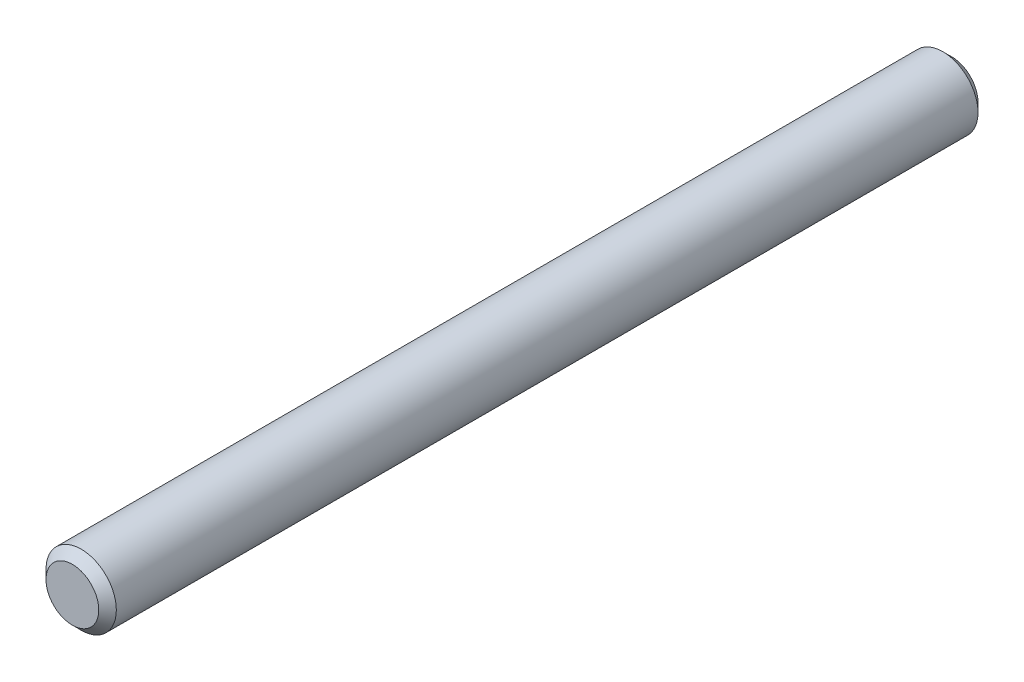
from build123d import *

# Parameters (mm, degrees)
SKETCH_1_R      = 2
EXTRUDE_1_DEPTH = 50
CHAMFER_1_SIZE  = 0.5


with BuildPart() as part:
    # Sketch 1 → Extrude 1 (new body)
    with BuildSketch(Plane.XY):
        Circle(SKETCH_1_R)
    extrude(amount=-EXTRUDE_1_DEPTH)

    # Chamfer 1
    chamfer_1_edges = [part.edges().sort_by_distance(p)[0] for p in [
        (-2, 0, 0),
        (-2, 0, -50),
    ]]
    chamfer(chamfer_1_edges, length=CHAMFER_1_SIZE)


solid = part.part
